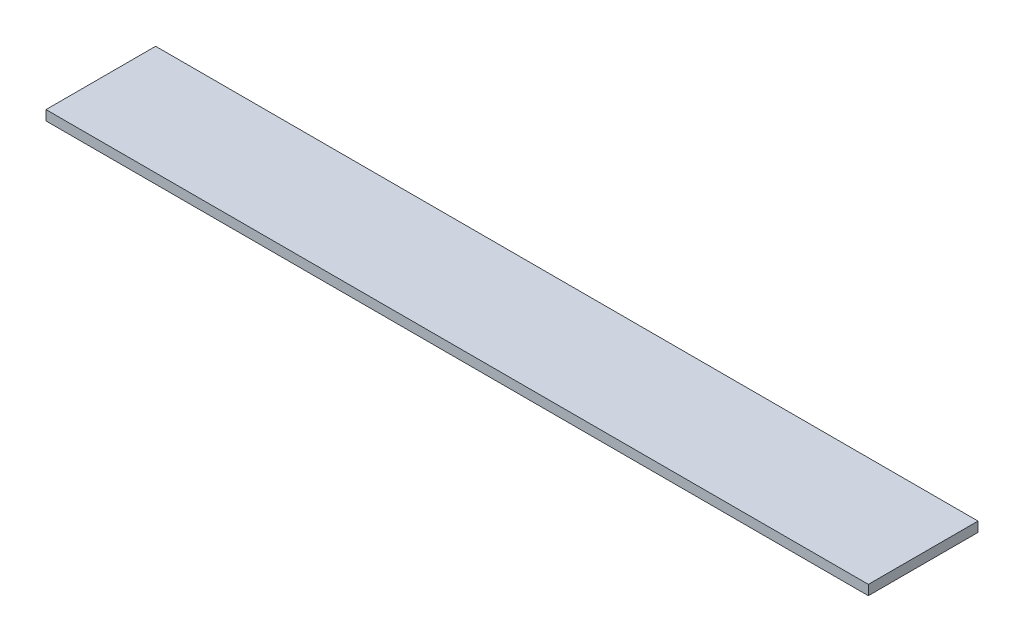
from build123d import *

# Parameters (mm, degrees)
ESQUISSE1_W        = 1500
ESQUISSE1_H        = 200
BOSS_EXTRU_1_DEPTH = 18


with BuildPart() as part:
    # Esquisse1 → Boss.-Extru.1 (new body)
    with BuildSketch(Plane(origin=(0, 0, 0), x_dir=(1, 0, 0), z_dir=(0, 1, 0))):
        Rectangle(ESQUISSE1_W, ESQUISSE1_H)
    extrude(amount=BOSS_EXTRU_1_DEPTH)


solid = part.part
